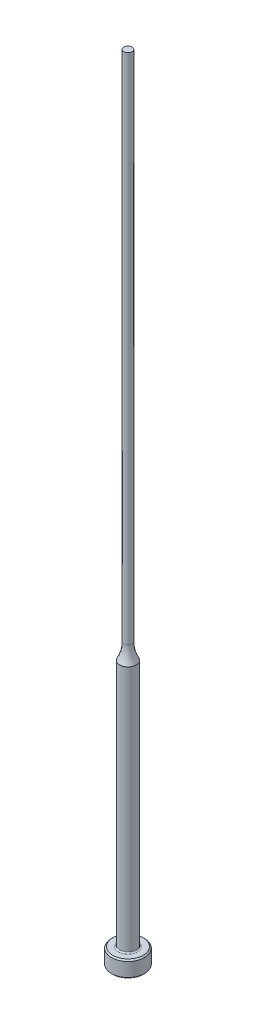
ISO-10303-21;
HEADER;
FILE_DESCRIPTION(('STEP AP214'),'2;1');
FILE_NAME('part.step','',(''),(''),'','','');
FILE_SCHEMA(('AUTOMOTIVE_DESIGN { 1 0 10303 214 1 1 1 1 }'));
ENDSEC;
DATA;
#1=APPLICATION_CONTEXT('core data for automotive mechanical design processes');
#2=APPLICATION_PROTOCOL_DEFINITION('international standard','automotive_design',2000,#1);
#3=PRODUCT_CONTEXT('',#1,'mechanical');
#4=PRODUCT('Part','Part','',(#3));
#5=PRODUCT_RELATED_PRODUCT_CATEGORY('part','',(#4));
#6=PRODUCT_DEFINITION_FORMATION('','',#4);
#7=PRODUCT_DEFINITION_CONTEXT('part definition',#1,'design');
#8=PRODUCT_DEFINITION('design','',#6,#7);
#9=PRODUCT_DEFINITION_SHAPE('','',#8);
#10=(LENGTH_UNIT() NAMED_UNIT(*) SI_UNIT(.MILLI.,.METRE.));
#11=(NAMED_UNIT(*) PLANE_ANGLE_UNIT() SI_UNIT($,.RADIAN.));
#12=(NAMED_UNIT(*) SI_UNIT($,.STERADIAN.) SOLID_ANGLE_UNIT());
#13=UNCERTAINTY_MEASURE_WITH_UNIT(LENGTH_MEASURE(1.E-05),#10,'distance_accuracy_value','');
#14=(GEOMETRIC_REPRESENTATION_CONTEXT(3) GLOBAL_UNCERTAINTY_ASSIGNED_CONTEXT((#13)) GLOBAL_UNIT_ASSIGNED_CONTEXT((#10,
#11,#12)) REPRESENTATION_CONTEXT('',''));
#15=CARTESIAN_POINT('',(0.,0.,0.));
#16=DIRECTION('',(0.,0.,1.));
#17=DIRECTION('',(1.,0.,0.));
#18=AXIS2_PLACEMENT_3D('',#15,#16,#17);
#19=CARTESIAN_POINT('',(-0.793749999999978,152.4,0.));
#20=DIRECTION('',(0.,1.,0.));
#21=DIRECTION('',(0.,0.,1.));
#22=AXIS2_PLACEMENT_3D('',#19,#20,#21);
#23=PLANE('',#22);
#24=CARTESIAN_POINT('',(0.,152.4,0.));
#25=DIRECTION('',(0.,1.,0.));
#26=DIRECTION('',(0.,0.,1.));
#27=AXIS2_PLACEMENT_3D('',#24,#25,#26);
#28=CIRCLE('',#27,0.793749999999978);
#29=CARTESIAN_POINT('',(0.,152.4,0.793749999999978));
#30=VERTEX_POINT('',#29);
#31=EDGE_CURVE('E61',#30,#30,#28,.T.);
#32=ORIENTED_EDGE('',*,*,#31,.T.);
#33=EDGE_LOOP('',(#32));
#34=FACE_BOUND('',#33,.T.);
#35=ADVANCED_FACE('F35',(#34),#23,.T.);
#36=CARTESIAN_POINT('',(0.,259.958771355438,0.));
#37=DIRECTION('',(0.,1.,0.));
#38=DIRECTION('',(0.,0.,1.));
#39=AXIS2_PLACEMENT_3D('',#36,#37,#38);
#40=CYLINDRICAL_SURFACE('',#39,0.793749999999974);
#41=CARTESIAN_POINT('',(0.,53.8741805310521,0.));
#42=DIRECTION('',(0.,1.,0.));
#43=DIRECTION('',(0.,0.,1.));
#44=AXIS2_PLACEMENT_3D('',#41,#42,#43);
#45=CIRCLE('',#44,0.79374999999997);
#46=CARTESIAN_POINT('',(0.,53.8741805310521,0.79374999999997));
#47=VERTEX_POINT('',#46);
#48=EDGE_CURVE('E64',#47,#47,#45,.T.);
#49=ORIENTED_EDGE('',*,*,#48,.T.);
#50=EDGE_LOOP('',(#49));
#51=FACE_BOUND('',#50,.T.);
#52=ORIENTED_EDGE('',*,*,#31,.F.);
#53=EDGE_LOOP('',(#52));
#54=FACE_BOUND('',#53,.T.);
#55=ADVANCED_FACE('F84',(#51,#54),#40,.T.);
#56=CARTESIAN_POINT('',(0.,53.8741805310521,0.));
#57=DIRECTION('',(0.,1.,0.));
#58=DIRECTION('',(0.,0.,1.));
#59=AXIS2_PLACEMENT_3D('',#56,#57,#58);
#60=TOROIDAL_SURFACE('',#59,7.14374999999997,6.35);
#61=CARTESIAN_POINT('',(0.,50.8,0.));
#62=DIRECTION('',(0.,1.,0.));
#63=DIRECTION('',(0.,0.,1.));
#64=AXIS2_PLACEMENT_3D('',#61,#62,#63);
#65=CIRCLE('',#64,1.58749999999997);
#66=CARTESIAN_POINT('',(0.,50.8,1.58749999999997));
#67=VERTEX_POINT('',#66);
#68=EDGE_CURVE('E67',#67,#67,#65,.T.);
#69=ORIENTED_EDGE('',*,*,#68,.T.);
#70=EDGE_LOOP('',(#69));
#71=FACE_BOUND('',#70,.T.);
#72=ORIENTED_EDGE('',*,*,#48,.F.);
#73=EDGE_LOOP('',(#72));
#74=FACE_BOUND('',#73,.T.);
#75=ADVANCED_FACE('F71',(#71,#74),#60,.F.);
#76=CARTESIAN_POINT('',(0.,259.958771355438,0.));
#77=DIRECTION('',(0.,1.,0.));
#78=DIRECTION('',(0.,0.,1.));
#79=AXIS2_PLACEMENT_3D('',#76,#77,#78);
#80=CYLINDRICAL_SURFACE('',#79,1.58749999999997);
#81=CARTESIAN_POINT('',(0.,3.42900000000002,0.));
#82=DIRECTION('',(0.,1.,0.));
#83=DIRECTION('',(0.,0.,1.));
#84=AXIS2_PLACEMENT_3D('',#81,#82,#83);
#85=CIRCLE('',#84,1.58749999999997);
#86=CARTESIAN_POINT('',(0.,3.42900000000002,1.58749999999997));
#87=VERTEX_POINT('',#86);
#88=EDGE_CURVE('E42',#87,#87,#85,.T.);
#89=ORIENTED_EDGE('',*,*,#88,.T.);
#90=EDGE_LOOP('',(#89));
#91=FACE_BOUND('',#90,.T.);
#92=ORIENTED_EDGE('',*,*,#68,.F.);
#93=EDGE_LOOP('',(#92));
#94=FACE_BOUND('',#93,.T.);
#95=ADVANCED_FACE('F74',(#91,#94),#80,.T.);
#96=CARTESIAN_POINT('',(-3.17499999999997,3.175,0.));
#97=DIRECTION('',(0.,1.,0.));
#98=DIRECTION('',(0.,0.,1.));
#99=AXIS2_PLACEMENT_3D('',#96,#97,#98);
#100=PLANE('',#99);
#101=CARTESIAN_POINT('',(0.,3.175,0.));
#102=DIRECTION('',(0.,1.,0.));
#103=DIRECTION('',(0.,0.,1.));
#104=AXIS2_PLACEMENT_3D('',#101,#102,#103);
#105=CIRCLE('',#104,1.84149999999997);
#106=CARTESIAN_POINT('',(0.,3.175,1.84149999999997));
#107=VERTEX_POINT('',#106);
#108=EDGE_CURVE('E10',#107,#107,#105,.F.);
#109=ORIENTED_EDGE('',*,*,#108,.T.);
#110=EDGE_LOOP('',(#109));
#111=FACE_BOUND('',#110,.T.);
#112=CARTESIAN_POINT('',(0.,3.175,0.));
#113=DIRECTION('',(0.,1.,0.));
#114=DIRECTION('',(0.,0.,1.));
#115=AXIS2_PLACEMENT_3D('',#112,#113,#114);
#116=CIRCLE('',#115,2.92099999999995);
#117=CARTESIAN_POINT('',(0.,3.175,2.92099999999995));
#118=VERTEX_POINT('',#117);
#119=EDGE_CURVE('E58',#118,#118,#116,.T.);
#120=ORIENTED_EDGE('',*,*,#119,.T.);
#121=EDGE_LOOP('',(#120));
#122=FACE_BOUND('',#121,.T.);
#123=ADVANCED_FACE('F76',(#111,#122),#100,.T.);
#124=CARTESIAN_POINT('',(0.,259.958771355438,0.));
#125=DIRECTION('',(0.,1.,0.));
#126=DIRECTION('',(0.,0.,1.));
#127=AXIS2_PLACEMENT_3D('',#124,#125,#126);
#128=CYLINDRICAL_SURFACE('',#127,3.17499999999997);
#129=CARTESIAN_POINT('',(0.,2.92100000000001,0.));
#130=DIRECTION('',(0.,1.,0.));
#131=DIRECTION('',(0.,0.,1.));
#132=AXIS2_PLACEMENT_3D('',#129,#130,#131);
#133=CIRCLE('',#132,3.17499999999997);
#134=CARTESIAN_POINT('',(0.,2.92100000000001,3.17499999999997));
#135=VERTEX_POINT('',#134);
#136=EDGE_CURVE('E50',#135,#135,#133,.F.);
#137=ORIENTED_EDGE('',*,*,#136,.T.);
#138=EDGE_LOOP('',(#137));
#139=FACE_BOUND('',#138,.T.);
#140=CARTESIAN_POINT('',(0.,0.254000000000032,0.));
#141=DIRECTION('',(0.,-1.,0.));
#142=DIRECTION('',(0.,0.,-1.));
#143=AXIS2_PLACEMENT_3D('',#140,#141,#142);
#144=CIRCLE('',#143,3.17499999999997);
#145=CARTESIAN_POINT('',(0.,0.254000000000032,-3.17499999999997));
#146=VERTEX_POINT('',#145);
#147=EDGE_CURVE('E55',#146,#146,#144,.F.);
#148=ORIENTED_EDGE('',*,*,#147,.T.);
#149=EDGE_LOOP('',(#148));
#150=FACE_BOUND('',#149,.T.);
#151=ADVANCED_FACE('F82',(#139,#150),#128,.T.);
#152=CARTESIAN_POINT('',(0.,0.,0.));
#153=DIRECTION('',(0.,-1.,0.));
#154=DIRECTION('',(0.,0.,-1.));
#155=AXIS2_PLACEMENT_3D('',#152,#153,#154);
#156=PLANE('',#155);
#157=CARTESIAN_POINT('',(0.,0.,0.));
#158=DIRECTION('',(0.,-1.,0.));
#159=DIRECTION('',(0.,0.,-1.));
#160=AXIS2_PLACEMENT_3D('',#157,#158,#159);
#161=CIRCLE('',#160,2.92099999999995);
#162=CARTESIAN_POINT('',(0.,0.,-2.92099999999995));
#163=VERTEX_POINT('',#162);
#164=EDGE_CURVE('E46',#163,#163,#161,.T.);
#165=ORIENTED_EDGE('',*,*,#164,.T.);
#166=EDGE_LOOP('',(#165));
#167=FACE_BOUND('',#166,.T.);
#168=ADVANCED_FACE('F98',(#167),#156,.T.);
#169=CARTESIAN_POINT('',(0.,3.17499999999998,0.));
#170=DIRECTION('',(0.,-1.,0.));
#171=DIRECTION('',(0.,0.,-1.));
#172=AXIS2_PLACEMENT_3D('',#169,#170,#171);
#173=CONICAL_SURFACE('',#172,2.92099999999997,0.7853981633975);
#174=ORIENTED_EDGE('',*,*,#136,.F.);
#175=EDGE_LOOP('',(#174));
#176=FACE_BOUND('',#175,.T.);
#177=ORIENTED_EDGE('',*,*,#119,.F.);
#178=EDGE_LOOP('',(#177));
#179=FACE_BOUND('',#178,.T.);
#180=ADVANCED_FACE('F95',(#176,#179),#173,.T.);
#181=CARTESIAN_POINT('',(0.,0.254000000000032,0.));
#182=DIRECTION('',(0.,1.,0.));
#183=DIRECTION('',(0.,0.,1.));
#184=AXIS2_PLACEMENT_3D('',#181,#182,#183);
#185=CONICAL_SURFACE('',#184,3.17499999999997,0.785398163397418);
#186=ORIENTED_EDGE('',*,*,#164,.F.);
#187=EDGE_LOOP('',(#186));
#188=FACE_BOUND('',#187,.T.);
#189=ORIENTED_EDGE('',*,*,#147,.F.);
#190=EDGE_LOOP('',(#189));
#191=FACE_BOUND('',#190,.T.);
#192=ADVANCED_FACE('F97',(#188,#191),#185,.T.);
#193=CARTESIAN_POINT('',(0.,3.42900000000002,0.));
#194=DIRECTION('',(0.,1.,0.));
#195=DIRECTION('',(0.,0.,1.));
#196=AXIS2_PLACEMENT_3D('',#193,#194,#195);
#197=TOROIDAL_SURFACE('',#196,1.84149999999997,0.254);
#198=ORIENTED_EDGE('',*,*,#108,.F.);
#199=EDGE_LOOP('',(#198));
#200=FACE_BOUND('',#199,.T.);
#201=ORIENTED_EDGE('',*,*,#88,.F.);
#202=EDGE_LOOP('',(#201));
#203=FACE_BOUND('',#202,.T.);
#204=ADVANCED_FACE('F37',(#200,#203),#197,.F.);
#205=CLOSED_SHELL('',(#35,#55,#75,#95,#123,#151,#168,#180,#192,#204));
#206=MANIFOLD_SOLID_BREP('B2',#205);
#207=ADVANCED_BREP_SHAPE_REPRESENTATION('',(#18,#206),#14);
#208=SHAPE_DEFINITION_REPRESENTATION(#9,#207);
ENDSEC;
END-ISO-10303-21;
